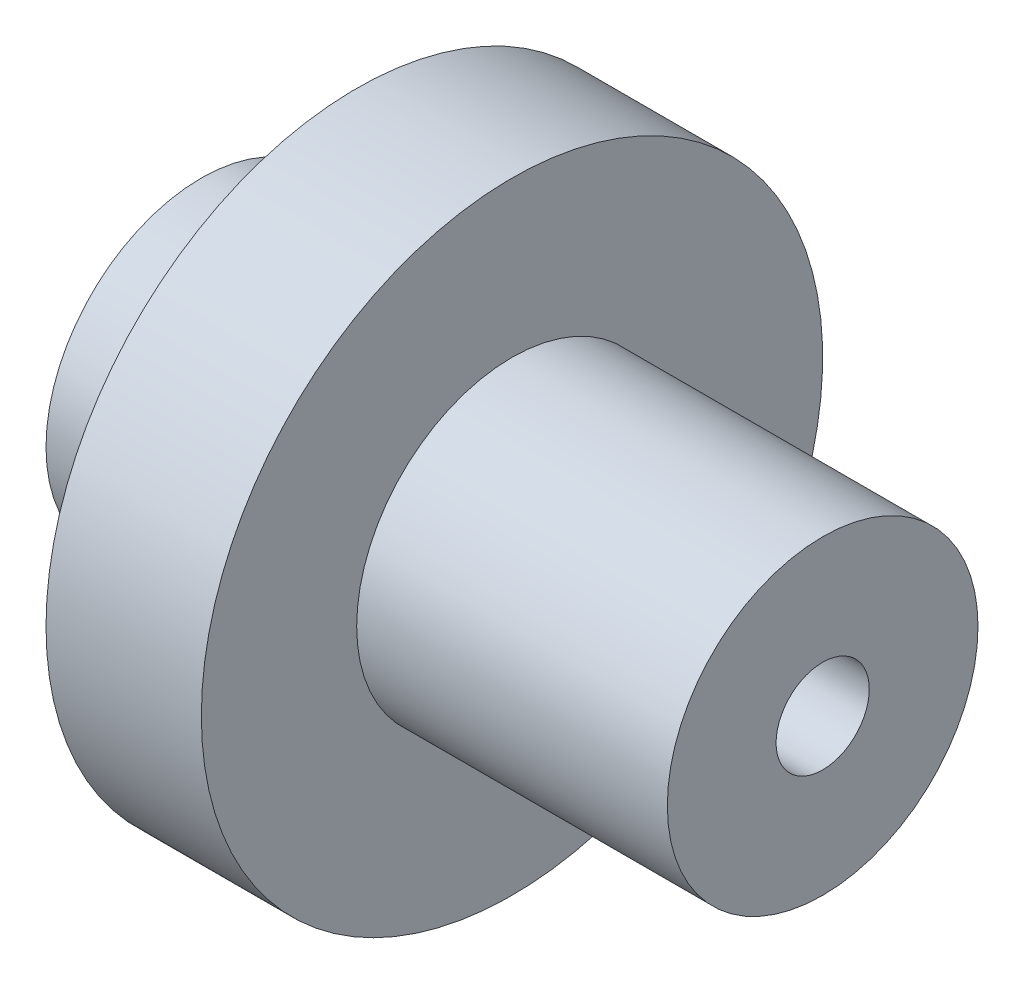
from build123d import *

# Parameters (mm, degrees)
SKETCH1_R      = 5
EXTRUDE1_DEPTH = 20
SKETCH2_R      = 1.5
EXTRUDE2_DEPTH = 10
EXTRUDE3_START = -11
SKETCH3_R      = 1.5
EXTRUDE3_DEPTH = 11
SKETCH4_W      = 5
SKETCH4_H      = 5


with BuildPart() as part:
    # Sketch1 → Extrude1 (new body)
    with BuildSketch(Plane(origin=(0, 0, 0), x_dir=(0, 0, -1), z_dir=(1, 0, 0))):
        Circle(SKETCH1_R)
    extrude(amount=EXTRUDE1_DEPTH)

    # Sketch2 → Extrude2 (cut)
    with BuildSketch(Plane.ZY):
        Circle(SKETCH2_R)
    extrude(amount=-EXTRUDE2_DEPTH, mode=Mode.SUBTRACT)

    # Sketch3 → Extrude3 (cut)
    with BuildSketch(Plane(origin=(20, 0, 0), x_dir=(0, 0, -1), z_dir=(1, 0, 0)).offset(EXTRUDE3_START)):
        with Locations(Location((0, 0, 0), (0, 0, 180))):
            Circle(SKETCH3_R)
    extrude(amount=EXTRUDE3_DEPTH, mode=Mode.SUBTRACT)

    # Sketch4 → Revolve1 (revolve)
    with BuildSketch(Plane.XY, mode=Mode.PRIVATE) as revolve1_sk:
        with Locations((7.5, 7.5)):
            Rectangle(SKETCH4_W, SKETCH4_H)
    revolve(revolve1_sk.sketch.rotate(Axis((0, 0, 0), (1, 0, 0)), 90), axis=Axis((0, 0, 0), (1, 0, 0)))


solid = part.part
